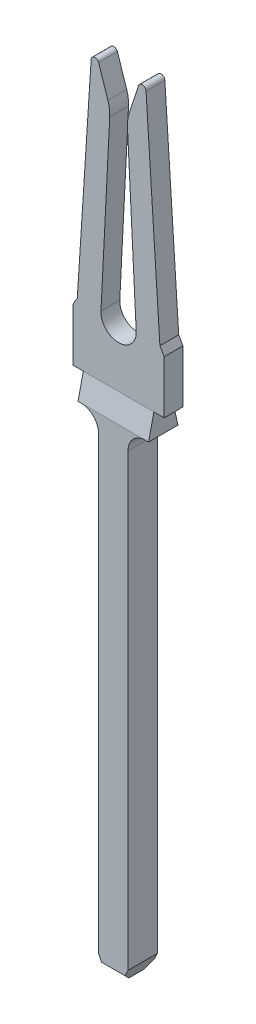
ISO-10303-21;
HEADER;
FILE_DESCRIPTION(('STEP AP214'),'2;1');
FILE_NAME('part.step','',(''),(''),'','','');
FILE_SCHEMA(('AUTOMOTIVE_DESIGN { 1 0 10303 214 1 1 1 1 }'));
ENDSEC;
DATA;
#1=APPLICATION_CONTEXT('core data for automotive mechanical design processes');
#2=APPLICATION_PROTOCOL_DEFINITION('international standard','automotive_design',2000,#1);
#3=PRODUCT_CONTEXT('',#1,'mechanical');
#4=PRODUCT('Part','Part','',(#3));
#5=PRODUCT_RELATED_PRODUCT_CATEGORY('part','',(#4));
#6=PRODUCT_DEFINITION_FORMATION('','',#4);
#7=PRODUCT_DEFINITION_CONTEXT('part definition',#1,'design');
#8=PRODUCT_DEFINITION('design','',#6,#7);
#9=PRODUCT_DEFINITION_SHAPE('','',#8);
#10=(LENGTH_UNIT() NAMED_UNIT(*) SI_UNIT(.MILLI.,.METRE.));
#11=(NAMED_UNIT(*) PLANE_ANGLE_UNIT() SI_UNIT($,.RADIAN.));
#12=(NAMED_UNIT(*) SI_UNIT($,.STERADIAN.) SOLID_ANGLE_UNIT());
#13=UNCERTAINTY_MEASURE_WITH_UNIT(LENGTH_MEASURE(1.E-05),#10,'distance_accuracy_value','');
#14=(GEOMETRIC_REPRESENTATION_CONTEXT(3) GLOBAL_UNCERTAINTY_ASSIGNED_CONTEXT((#13)) GLOBAL_UNIT_ASSIGNED_CONTEXT((#10,
#11,#12)) REPRESENTATION_CONTEXT('',''));
#15=CARTESIAN_POINT('',(0.,0.,0.));
#16=DIRECTION('',(0.,0.,1.));
#17=DIRECTION('',(1.,0.,0.));
#18=AXIS2_PLACEMENT_3D('',#15,#16,#17);
#19=CARTESIAN_POINT('',(-0.510191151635,5.91185,0.2032));
#20=DIRECTION('',(0.,0.,1.));
#21=DIRECTION('',(1.,0.,0.));
#22=AXIS2_PLACEMENT_3D('',#19,#20,#21);
#23=PLANE('',#22);
#24=DIRECTION('',(-0.0647635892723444,-0.99790063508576,0.));
#25=VECTOR('',#24,1.);
#26=CARTESIAN_POINT('',(-0.892048,1.302698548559,0.2032));
#27=LINE('',#26,#25);
#28=CARTESIAN_POINT('',(-0.892048,1.302698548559,0.2032));
#29=VERTEX_POINT('',#28);
#30=CARTESIAN_POINT('',(-0.592567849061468,5.91719623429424,0.2032));
#31=VERTEX_POINT('',#30);
#32=EDGE_CURVE('E186',#29,#31,#27,.F.);
#33=ORIENTED_EDGE('',*,*,#32,.F.);
#34=DIRECTION('',(-0.500000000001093,-0.866025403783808,0.));
#35=VECTOR('',#34,1.);
#36=CARTESIAN_POINT('',(-0.892048,1.302698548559,0.2032));
#37=LINE('',#36,#35);
#38=CARTESIAN_POINT('',(-0.984249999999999,1.143,0.2032));
#39=VERTEX_POINT('',#38);
#40=EDGE_CURVE('E178',#29,#39,#37,.T.);
#41=ORIENTED_EDGE('',*,*,#40,.T.);
#42=DIRECTION('',(0.,1.,0.));
#43=VECTOR('',#42,1.);
#44=CARTESIAN_POINT('',(-0.98425,5.91185,0.2032));
#45=LINE('',#44,#43);
#46=CARTESIAN_POINT('',(-0.98425,0.,0.2032));
#47=VERTEX_POINT('',#46);
#48=EDGE_CURVE('E161',#39,#47,#45,.F.);
#49=ORIENTED_EDGE('',*,*,#48,.T.);
#50=DIRECTION('',(1.,0.,0.));
#51=VECTOR('',#50,1.);
#52=CARTESIAN_POINT('',(-0.510191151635,0.,0.2032));
#53=LINE('',#52,#51);
#54=CARTESIAN_POINT('',(-0.762,0.,0.2032));
#55=VERTEX_POINT('',#54);
#56=EDGE_CURVE('E172',#47,#55,#53,.T.);
#57=ORIENTED_EDGE('',*,*,#56,.T.);
#58=DIRECTION('',(1.,0.,0.));
#59=VECTOR('',#58,1.);
#60=CARTESIAN_POINT('',(-0.510191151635,0.,0.2032));
#61=LINE('',#60,#59);
#62=CARTESIAN_POINT('',(0.762,0.,0.2032));
#63=VERTEX_POINT('',#62);
#64=EDGE_CURVE('E228',#55,#63,#61,.T.);
#65=ORIENTED_EDGE('',*,*,#64,.T.);
#66=DIRECTION('',(1.,0.,0.));
#67=VECTOR('',#66,1.);
#68=CARTESIAN_POINT('',(-0.510191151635,0.,0.2032));
#69=LINE('',#68,#67);
#70=CARTESIAN_POINT('',(0.98425,0.,0.2032));
#71=VERTEX_POINT('',#70);
#72=EDGE_CURVE('E192',#63,#71,#69,.T.);
#73=ORIENTED_EDGE('',*,*,#72,.T.);
#74=DIRECTION('',(0.,1.,0.));
#75=VECTOR('',#74,1.);
#76=CARTESIAN_POINT('',(0.98425,5.91185,0.2032));
#77=LINE('',#76,#75);
#78=CARTESIAN_POINT('',(0.984249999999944,1.14299999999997,0.2032));
#79=VERTEX_POINT('',#78);
#80=EDGE_CURVE('E188',#71,#79,#77,.T.);
#81=ORIENTED_EDGE('',*,*,#80,.T.);
#82=DIRECTION('',(-0.50000000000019,0.866025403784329,0.));
#83=VECTOR('',#82,1.);
#84=CARTESIAN_POINT('',(0.892048,1.302698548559,0.2032));
#85=LINE('',#84,#83);
#86=CARTESIAN_POINT('',(0.892048,1.302698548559,0.2032));
#87=VERTEX_POINT('',#86);
#88=EDGE_CURVE('E135',#87,#79,#85,.F.);
#89=ORIENTED_EDGE('',*,*,#88,.F.);
#90=DIRECTION('',(0.0647635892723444,-0.99790063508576,0.));
#91=VECTOR('',#90,1.);
#92=CARTESIAN_POINT('',(0.892048,1.302698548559,0.2032));
#93=LINE('',#92,#91);
#94=CARTESIAN_POINT('',(0.592567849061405,5.91719623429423,0.2032));
#95=VERTEX_POINT('',#94);
#96=EDGE_CURVE('E129',#87,#95,#93,.F.);
#97=ORIENTED_EDGE('',*,*,#96,.T.);
#98=CARTESIAN_POINT('',(0.510191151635,5.91185,0.2032));
#99=DIRECTION('',(0.,0.,-1.));
#100=DIRECTION('',(-1.,0.,0.));
#101=AXIS2_PLACEMENT_3D('',#98,#99,#100);
#102=CIRCLE('',#101,0.08255);
#103=CARTESIAN_POINT('',(0.431799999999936,5.93772140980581,0.2032));
#104=VERTEX_POINT('',#103);
#105=EDGE_CURVE('E20',#104,#95,#102,.T.);
#106=ORIENTED_EDGE('',*,*,#105,.F.);
#107=DIRECTION('',(0.313402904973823,0.949620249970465,0.));
#108=VECTOR('',#107,1.);
#109=CARTESIAN_POINT('',(0.4318,5.937721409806,0.2032));
#110=LINE('',#109,#108);
#111=CARTESIAN_POINT('',(0.230169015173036,5.32677344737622,0.2032));
#112=VERTEX_POINT('',#111);
#113=EDGE_CURVE('E215',#104,#112,#110,.F.);
#114=ORIENTED_EDGE('',*,*,#113,.T.);
#115=CARTESIAN_POINT('',(0.9779,5.08,0.2032));
#116=DIRECTION('',(0.,0.,-1.));
#117=DIRECTION('',(-1.,0.,0.));
#118=AXIS2_PLACEMENT_3D('',#115,#116,#117);
#119=CIRCLE('',#118,0.7874);
#120=CARTESIAN_POINT('',(0.191511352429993,5.04010444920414,0.2032));
#121=VERTEX_POINT('',#120);
#122=EDGE_CURVE('E277',#121,#112,#119,.T.);
#123=ORIENTED_EDGE('',*,*,#122,.F.);
#124=DIRECTION('',(-0.0506674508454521,0.998715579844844,0.));
#125=VECTOR('',#124,1.);
#126=CARTESIAN_POINT('',(0.19151135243,5.040104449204,0.2032));
#127=LINE('',#126,#125);
#128=CARTESIAN_POINT('',(0.380510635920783,1.31470429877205,0.2032));
#129=VERTEX_POINT('',#128);
#130=EDGE_CURVE('E210',#121,#129,#127,.F.);
#131=ORIENTED_EDGE('',*,*,#130,.T.);
#132=CARTESIAN_POINT('',(0.,1.2954,0.2032));
#133=DIRECTION('',(0.,0.,1.));
#134=DIRECTION('',(1.,0.,0.));
#135=AXIS2_PLACEMENT_3D('',#132,#133,#134);
#136=CIRCLE('',#135,0.381);
#137=CARTESIAN_POINT('',(-0.380510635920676,1.31470429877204,0.2032));
#138=VERTEX_POINT('',#137);
#139=EDGE_CURVE('E209',#129,#138,#136,.F.);
#140=ORIENTED_EDGE('',*,*,#139,.T.);
#141=DIRECTION('',(0.0506674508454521,0.998715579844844,0.));
#142=VECTOR('',#141,1.);
#143=CARTESIAN_POINT('',(-0.19151135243,5.040104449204,0.2032));
#144=LINE('',#143,#142);
#145=CARTESIAN_POINT('',(-0.191511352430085,5.04010444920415,0.2032));
#146=VERTEX_POINT('',#145);
#147=EDGE_CURVE('E205',#146,#138,#144,.F.);
#148=ORIENTED_EDGE('',*,*,#147,.F.);
#149=CARTESIAN_POINT('',(-0.9779,5.08,0.2032));
#150=DIRECTION('',(0.,0.,-1.));
#151=DIRECTION('',(-1.,0.,0.));
#152=AXIS2_PLACEMENT_3D('',#149,#150,#151);
#153=CIRCLE('',#152,0.7874);
#154=CARTESIAN_POINT('',(-0.230169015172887,5.32677344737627,0.2032));
#155=VERTEX_POINT('',#154);
#156=EDGE_CURVE('E274',#155,#146,#153,.T.);
#157=ORIENTED_EDGE('',*,*,#156,.F.);
#158=DIRECTION('',(-0.313402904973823,0.949620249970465,0.));
#159=VECTOR('',#158,1.);
#160=CARTESIAN_POINT('',(-0.4318,5.937721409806,0.2032));
#161=LINE('',#160,#159);
#162=CARTESIAN_POINT('',(-0.431799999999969,5.9377214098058,0.2032));
#163=VERTEX_POINT('',#162);
#164=EDGE_CURVE('E200',#163,#155,#161,.F.);
#165=ORIENTED_EDGE('',*,*,#164,.F.);
#166=CARTESIAN_POINT('',(-0.510191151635,5.91185,0.2032));
#167=DIRECTION('',(0.,0.,-1.));
#168=DIRECTION('',(-1.,0.,0.));
#169=AXIS2_PLACEMENT_3D('',#166,#167,#168);
#170=CIRCLE('',#169,0.08255);
#171=EDGE_CURVE('E270',#31,#163,#170,.T.);
#172=ORIENTED_EDGE('',*,*,#171,.F.);
#173=EDGE_LOOP('',(#33,#41,#49,#57,#65,#73,#81,#89,#97,#106,#114,#123,#131,#140,#148,#157,#165,#172));
#174=FACE_BOUND('',#173,.T.);
#175=ADVANCED_FACE('F17',(#174),#23,.T.);
#176=CARTESIAN_POINT('',(0.892048,1.302698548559,0.2032));
#177=DIRECTION('',(0.866025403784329,0.50000000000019,0.));
#178=DIRECTION('',(-0.50000000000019,0.866025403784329,0.));
#179=AXIS2_PLACEMENT_3D('',#176,#177,#178);
#180=PLANE('',#179);
#181=ORIENTED_EDGE('',*,*,#88,.T.);
#182=DIRECTION('',(0.,0.,1.));
#183=VECTOR('',#182,1.);
#184=CARTESIAN_POINT('',(0.98425,1.143,0.2032));
#185=LINE('',#184,#183);
#186=CARTESIAN_POINT('',(0.98425,1.143,-0.2032));
#187=VERTEX_POINT('',#186);
#188=EDGE_CURVE('E182',#79,#187,#185,.F.);
#189=ORIENTED_EDGE('',*,*,#188,.T.);
#190=DIRECTION('',(-0.500000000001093,0.866025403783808,0.));
#191=VECTOR('',#190,1.);
#192=CARTESIAN_POINT('',(0.98425,1.143,-0.2032));
#193=LINE('',#192,#191);
#194=CARTESIAN_POINT('',(0.892048,1.302698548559,-0.2032));
#195=VERTEX_POINT('',#194);
#196=EDGE_CURVE('E293',#187,#195,#193,.T.);
#197=ORIENTED_EDGE('',*,*,#196,.T.);
#198=DIRECTION('',(0.,0.,1.));
#199=VECTOR('',#198,1.);
#200=CARTESIAN_POINT('',(0.892048,1.302698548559,0.2032));
#201=LINE('',#200,#199);
#202=EDGE_CURVE('E190',#195,#87,#201,.T.);
#203=ORIENTED_EDGE('',*,*,#202,.T.);
#204=EDGE_LOOP('',(#181,#189,#197,#203));
#205=FACE_BOUND('',#204,.T.);
#206=ADVANCED_FACE('F394',(#205),#180,.T.);
#207=CARTESIAN_POINT('',(0.892048,1.302698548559,0.2032));
#208=DIRECTION('',(-0.99790063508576,-0.0647635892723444,0.));
#209=DIRECTION('',(0.0647635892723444,-0.99790063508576,0.));
#210=AXIS2_PLACEMENT_3D('',#207,#208,#209);
#211=PLANE('',#210);
#212=DIRECTION('',(0.,0.,-1.));
#213=VECTOR('',#212,1.);
#214=CARTESIAN_POINT('',(0.592567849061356,5.91719623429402,0.2032));
#215=LINE('',#214,#213);
#216=CARTESIAN_POINT('',(0.592567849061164,5.91719623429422,-0.2032));
#217=VERTEX_POINT('',#216);
#218=EDGE_CURVE('E287',#95,#217,#215,.T.);
#219=ORIENTED_EDGE('',*,*,#218,.F.);
#220=ORIENTED_EDGE('',*,*,#96,.F.);
#221=ORIENTED_EDGE('',*,*,#202,.F.);
#222=DIRECTION('',(-0.0647635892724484,0.997900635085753,0.));
#223=VECTOR('',#222,1.);
#224=CARTESIAN_POINT('',(0.892048,1.302698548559,-0.2032));
#225=LINE('',#224,#223);
#226=EDGE_CURVE('E269',#195,#217,#225,.T.);
#227=ORIENTED_EDGE('',*,*,#226,.T.);
#228=EDGE_LOOP('',(#219,#220,#221,#227));
#229=FACE_BOUND('',#228,.T.);
#230=ADVANCED_FACE('F397',(#229),#211,.F.);
#231=CARTESIAN_POINT('',(0.510191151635,5.91185,0.2032));
#232=DIRECTION('',(0.,0.,-1.));
#233=DIRECTION('',(-1.,0.,0.));
#234=AXIS2_PLACEMENT_3D('',#231,#232,#233);
#235=CYLINDRICAL_SURFACE('',#234,0.08255);
#236=ORIENTED_EDGE('',*,*,#105,.T.);
#237=ORIENTED_EDGE('',*,*,#218,.T.);
#238=CARTESIAN_POINT('',(0.510191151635,5.91185,-0.2032));
#239=DIRECTION('',(0.,0.,-1.));
#240=DIRECTION('',(-1.,0.,0.));
#241=AXIS2_PLACEMENT_3D('',#238,#239,#240);
#242=CIRCLE('',#241,0.08255);
#243=CARTESIAN_POINT('',(0.431799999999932,5.93772140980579,-0.2032));
#244=VERTEX_POINT('',#243);
#245=EDGE_CURVE('E267',#217,#244,#242,.F.);
#246=ORIENTED_EDGE('',*,*,#245,.T.);
#247=DIRECTION('',(0.,0.,1.));
#248=VECTOR('',#247,1.);
#249=CARTESIAN_POINT('',(0.4318,5.937721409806,0.2032));
#250=LINE('',#249,#248);
#251=EDGE_CURVE('E218',#244,#104,#250,.T.);
#252=ORIENTED_EDGE('',*,*,#251,.T.);
#253=EDGE_LOOP('',(#236,#237,#246,#252));
#254=FACE_BOUND('',#253,.T.);
#255=ADVANCED_FACE('F399',(#254),#235,.T.);
#256=CARTESIAN_POINT('',(0.4318,5.937721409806,0.2032));
#257=DIRECTION('',(0.949620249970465,-0.313402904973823,0.));
#258=DIRECTION('',(0.313402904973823,0.949620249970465,0.));
#259=AXIS2_PLACEMENT_3D('',#256,#257,#258);
#260=PLANE('',#259);
#261=DIRECTION('',(0.,0.,-1.));
#262=VECTOR('',#261,1.);
#263=CARTESIAN_POINT('',(0.230169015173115,5.32677344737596,0.2032));
#264=LINE('',#263,#262);
#265=CARTESIAN_POINT('',(0.230169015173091,5.32677344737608,-0.2032));
#266=VERTEX_POINT('',#265);
#267=EDGE_CURVE('E217',#112,#266,#264,.T.);
#268=ORIENTED_EDGE('',*,*,#267,.F.);
#269=ORIENTED_EDGE('',*,*,#113,.F.);
#270=ORIENTED_EDGE('',*,*,#251,.F.);
#271=DIRECTION('',(-0.313402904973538,-0.949620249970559,0.));
#272=VECTOR('',#271,1.);
#273=CARTESIAN_POINT('',(0.4318,5.937721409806,-0.2032));
#274=LINE('',#273,#272);
#275=EDGE_CURVE('E266',#244,#266,#274,.T.);
#276=ORIENTED_EDGE('',*,*,#275,.T.);
#277=EDGE_LOOP('',(#268,#269,#270,#276));
#278=FACE_BOUND('',#277,.T.);
#279=ADVANCED_FACE('F341',(#278),#260,.F.);
#280=CARTESIAN_POINT('',(0.9779,5.08,0.2032));
#281=DIRECTION('',(0.,0.,-1.));
#282=DIRECTION('',(-1.,0.,0.));
#283=AXIS2_PLACEMENT_3D('',#280,#281,#282);
#284=CYLINDRICAL_SURFACE('',#283,0.7874);
#285=CARTESIAN_POINT('',(0.9779,5.08,-0.2032));
#286=DIRECTION('',(0.,0.,-1.));
#287=DIRECTION('',(-1.,0.,0.));
#288=AXIS2_PLACEMENT_3D('',#285,#286,#287);
#289=CIRCLE('',#288,0.7874);
#290=CARTESIAN_POINT('',(0.191511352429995,5.04010444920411,-0.2032));
#291=VERTEX_POINT('',#290);
#292=EDGE_CURVE('E264',#266,#291,#289,.F.);
#293=ORIENTED_EDGE('',*,*,#292,.T.);
#294=DIRECTION('',(0.,0.,1.));
#295=VECTOR('',#294,1.);
#296=CARTESIAN_POINT('',(0.19151135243,5.040104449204,0.2032));
#297=LINE('',#296,#295);
#298=EDGE_CURVE('E214',#291,#121,#297,.T.);
#299=ORIENTED_EDGE('',*,*,#298,.T.);
#300=ORIENTED_EDGE('',*,*,#122,.T.);
#301=ORIENTED_EDGE('',*,*,#267,.T.);
#302=EDGE_LOOP('',(#293,#299,#300,#301));
#303=FACE_BOUND('',#302,.T.);
#304=ADVANCED_FACE('F334',(#303),#284,.T.);
#305=CARTESIAN_POINT('',(0.19151135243,5.040104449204,0.2032));
#306=DIRECTION('',(0.998715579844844,0.0506674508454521,0.));
#307=DIRECTION('',(-0.0506674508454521,0.998715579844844,0.));
#308=AXIS2_PLACEMENT_3D('',#305,#306,#307);
#309=PLANE('',#308);
#310=DIRECTION('',(0.,0.,-1.));
#311=VECTOR('',#310,1.);
#312=CARTESIAN_POINT('',(0.380510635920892,1.31470429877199,0.2032));
#313=LINE('',#312,#311);
#314=CARTESIAN_POINT('',(0.380510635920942,1.31470429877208,-0.2032));
#315=VERTEX_POINT('',#314);
#316=EDGE_CURVE('E213',#315,#129,#313,.F.);
#317=ORIENTED_EDGE('',*,*,#316,.T.);
#318=ORIENTED_EDGE('',*,*,#130,.F.);
#319=ORIENTED_EDGE('',*,*,#298,.F.);
#320=DIRECTION('',(0.050667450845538,-0.99871557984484,0.));
#321=VECTOR('',#320,1.);
#322=CARTESIAN_POINT('',(0.19151135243,5.040104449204,-0.2032));
#323=LINE('',#322,#321);
#324=EDGE_CURVE('E263',#291,#315,#323,.T.);
#325=ORIENTED_EDGE('',*,*,#324,.T.);
#326=EDGE_LOOP('',(#317,#318,#319,#325));
#327=FACE_BOUND('',#326,.T.);
#328=ADVANCED_FACE('F327',(#327),#309,.F.);
#329=CARTESIAN_POINT('',(0.,1.2954,0.2032));
#330=DIRECTION('',(0.,0.,-1.));
#331=DIRECTION('',(-1.,0.,0.));
#332=AXIS2_PLACEMENT_3D('',#329,#330,#331);
#333=CYLINDRICAL_SURFACE('',#332,0.381);
#334=CARTESIAN_POINT('',(0.,1.2954,-0.2032));
#335=DIRECTION('',(0.,0.,-1.));
#336=DIRECTION('',(-1.,0.,0.));
#337=AXIS2_PLACEMENT_3D('',#334,#335,#336);
#338=CIRCLE('',#337,0.381);
#339=CARTESIAN_POINT('',(-0.380510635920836,1.31470429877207,-0.2032));
#340=VERTEX_POINT('',#339);
#341=EDGE_CURVE('E261',#315,#340,#338,.T.);
#342=ORIENTED_EDGE('',*,*,#341,.T.);
#343=DIRECTION('',(0.,0.,1.));
#344=VECTOR('',#343,1.);
#345=CARTESIAN_POINT('',(-0.38051063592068,1.31470429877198,0.2032));
#346=LINE('',#345,#344);
#347=EDGE_CURVE('E208',#138,#340,#346,.F.);
#348=ORIENTED_EDGE('',*,*,#347,.F.);
#349=ORIENTED_EDGE('',*,*,#139,.F.);
#350=ORIENTED_EDGE('',*,*,#316,.F.);
#351=EDGE_LOOP('',(#342,#348,#349,#350));
#352=FACE_BOUND('',#351,.T.);
#353=ADVANCED_FACE('F331',(#352),#333,.F.);
#354=CARTESIAN_POINT('',(-0.19151135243,5.040104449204,0.2032));
#355=DIRECTION('',(0.998715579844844,-0.0506674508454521,0.));
#356=DIRECTION('',(0.0506674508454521,0.998715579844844,0.));
#357=AXIS2_PLACEMENT_3D('',#354,#355,#356);
#358=PLANE('',#357);
#359=ORIENTED_EDGE('',*,*,#147,.T.);
#360=ORIENTED_EDGE('',*,*,#347,.T.);
#361=DIRECTION('',(0.050667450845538,0.99871557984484,0.));
#362=VECTOR('',#361,1.);
#363=CARTESIAN_POINT('',(-0.380510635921,1.314704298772,-0.2032));
#364=LINE('',#363,#362);
#365=CARTESIAN_POINT('',(-0.191511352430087,5.04010444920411,-0.2032));
#366=VERTEX_POINT('',#365);
#367=EDGE_CURVE('E260',#340,#366,#364,.T.);
#368=ORIENTED_EDGE('',*,*,#367,.T.);
#369=DIRECTION('',(0.,0.,-1.));
#370=VECTOR('',#369,1.);
#371=CARTESIAN_POINT('',(-0.191511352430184,5.04010444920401,0.2032));
#372=LINE('',#371,#370);
#373=EDGE_CURVE('E204',#146,#366,#372,.T.);
#374=ORIENTED_EDGE('',*,*,#373,.F.);
#375=EDGE_LOOP('',(#359,#360,#368,#374));
#376=FACE_BOUND('',#375,.T.);
#377=ADVANCED_FACE('F509',(#376),#358,.T.);
#378=CARTESIAN_POINT('',(-0.9779,5.08,0.2032));
#379=DIRECTION('',(0.,0.,-1.));
#380=DIRECTION('',(-1.,0.,0.));
#381=AXIS2_PLACEMENT_3D('',#378,#379,#380);
#382=CYLINDRICAL_SURFACE('',#381,0.7874);
#383=ORIENTED_EDGE('',*,*,#156,.T.);
#384=ORIENTED_EDGE('',*,*,#373,.T.);
#385=CARTESIAN_POINT('',(-0.9779,5.08,-0.2032));
#386=DIRECTION('',(0.,0.,-1.));
#387=DIRECTION('',(-1.,0.,0.));
#388=AXIS2_PLACEMENT_3D('',#385,#386,#387);
#389=CIRCLE('',#388,0.7874);
#390=CARTESIAN_POINT('',(-0.230169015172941,5.32677344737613,-0.2032));
#391=VERTEX_POINT('',#390);
#392=EDGE_CURVE('E258',#366,#391,#389,.F.);
#393=ORIENTED_EDGE('',*,*,#392,.T.);
#394=DIRECTION('',(0.,0.,1.));
#395=VECTOR('',#394,1.);
#396=CARTESIAN_POINT('',(-0.230169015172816,5.32677344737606,0.2032));
#397=LINE('',#396,#395);
#398=EDGE_CURVE('E203',#155,#391,#397,.F.);
#399=ORIENTED_EDGE('',*,*,#398,.F.);
#400=EDGE_LOOP('',(#383,#384,#393,#399));
#401=FACE_BOUND('',#400,.T.);
#402=ADVANCED_FACE('F505',(#401),#382,.T.);
#403=CARTESIAN_POINT('',(-0.4318,5.937721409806,0.2032));
#404=DIRECTION('',(0.949620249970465,0.313402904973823,0.));
#405=DIRECTION('',(-0.313402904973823,0.949620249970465,0.));
#406=AXIS2_PLACEMENT_3D('',#403,#404,#405);
#407=PLANE('',#406);
#408=ORIENTED_EDGE('',*,*,#164,.T.);
#409=ORIENTED_EDGE('',*,*,#398,.T.);
#410=DIRECTION('',(-0.313402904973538,0.949620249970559,0.));
#411=VECTOR('',#410,1.);
#412=CARTESIAN_POINT('',(-0.230169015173,5.326773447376,-0.2032));
#413=LINE('',#412,#411);
#414=CARTESIAN_POINT('',(-0.431799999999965,5.93772140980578,-0.2032));
#415=VERTEX_POINT('',#414);
#416=EDGE_CURVE('E257',#391,#415,#413,.T.);
#417=ORIENTED_EDGE('',*,*,#416,.T.);
#418=DIRECTION('',(0.,0.,-1.));
#419=VECTOR('',#418,1.);
#420=CARTESIAN_POINT('',(-0.431800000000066,5.93772140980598,0.2032));
#421=LINE('',#420,#419);
#422=EDGE_CURVE('E273',#163,#415,#421,.T.);
#423=ORIENTED_EDGE('',*,*,#422,.F.);
#424=EDGE_LOOP('',(#408,#409,#417,#423));
#425=FACE_BOUND('',#424,.T.);
#426=ADVANCED_FACE('F502',(#425),#407,.T.);
#427=CARTESIAN_POINT('',(-0.510191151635,5.91185,0.2032));
#428=DIRECTION('',(0.,0.,-1.));
#429=DIRECTION('',(-1.,0.,0.));
#430=AXIS2_PLACEMENT_3D('',#427,#428,#429);
#431=CYLINDRICAL_SURFACE('',#430,0.08255);
#432=ORIENTED_EDGE('',*,*,#171,.T.);
#433=ORIENTED_EDGE('',*,*,#422,.T.);
#434=CARTESIAN_POINT('',(-0.510191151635,5.91185,-0.2032));
#435=DIRECTION('',(0.,0.,-1.));
#436=DIRECTION('',(-1.,0.,0.));
#437=AXIS2_PLACEMENT_3D('',#434,#435,#436);
#438=CIRCLE('',#437,0.08255);
#439=CARTESIAN_POINT('',(-0.592567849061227,5.91719623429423,-0.2032));
#440=VERTEX_POINT('',#439);
#441=EDGE_CURVE('E254',#415,#440,#438,.F.);
#442=ORIENTED_EDGE('',*,*,#441,.T.);
#443=DIRECTION('',(0.,0.,1.));
#444=VECTOR('',#443,1.);
#445=CARTESIAN_POINT('',(-0.592567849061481,5.91719623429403,0.2032));
#446=LINE('',#445,#444);
#447=EDGE_CURVE('E304',#31,#440,#446,.F.);
#448=ORIENTED_EDGE('',*,*,#447,.F.);
#449=EDGE_LOOP('',(#432,#433,#442,#448));
#450=FACE_BOUND('',#449,.T.);
#451=ADVANCED_FACE('F499',(#450),#431,.T.);
#452=CARTESIAN_POINT('',(-0.892048,1.302698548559,0.2032));
#453=DIRECTION('',(-0.99790063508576,0.0647635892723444,0.));
#454=DIRECTION('',(-0.0647635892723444,-0.99790063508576,0.));
#455=AXIS2_PLACEMENT_3D('',#452,#453,#454);
#456=PLANE('',#455);
#457=ORIENTED_EDGE('',*,*,#32,.T.);
#458=ORIENTED_EDGE('',*,*,#447,.T.);
#459=DIRECTION('',(-0.0647635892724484,-0.997900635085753,0.));
#460=VECTOR('',#459,1.);
#461=CARTESIAN_POINT('',(-0.592567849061,5.917196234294,-0.2032));
#462=LINE('',#461,#460);
#463=CARTESIAN_POINT('',(-0.892048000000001,1.302698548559,-0.2032));
#464=VERTEX_POINT('',#463);
#465=EDGE_CURVE('E256',#440,#464,#462,.T.);
#466=ORIENTED_EDGE('',*,*,#465,.T.);
#467=DIRECTION('',(0.,0.,1.));
#468=VECTOR('',#467,1.);
#469=CARTESIAN_POINT('',(-0.892048,1.302698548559,0.2032));
#470=LINE('',#469,#468);
#471=EDGE_CURVE('E183',#464,#29,#470,.T.);
#472=ORIENTED_EDGE('',*,*,#471,.T.);
#473=EDGE_LOOP('',(#457,#458,#466,#472));
#474=FACE_BOUND('',#473,.T.);
#475=ADVANCED_FACE('F375',(#474),#456,.T.);
#476=CARTESIAN_POINT('',(-0.892048,1.302698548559,0.2032));
#477=DIRECTION('',(0.866025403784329,-0.50000000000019,0.));
#478=DIRECTION('',(0.50000000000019,0.866025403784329,0.));
#479=AXIS2_PLACEMENT_3D('',#476,#477,#478);
#480=PLANE('',#479);
#481=DIRECTION('',(0.,0.,1.));
#482=VECTOR('',#481,1.);
#483=CARTESIAN_POINT('',(-0.98425,1.143,0.2032));
#484=LINE('',#483,#482);
#485=CARTESIAN_POINT('',(-0.98425,1.143,-0.2032));
#486=VERTEX_POINT('',#485);
#487=EDGE_CURVE('E166',#39,#486,#484,.F.);
#488=ORIENTED_EDGE('',*,*,#487,.F.);
#489=ORIENTED_EDGE('',*,*,#40,.F.);
#490=ORIENTED_EDGE('',*,*,#471,.F.);
#491=DIRECTION('',(-0.500000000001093,-0.866025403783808,0.));
#492=VECTOR('',#491,1.);
#493=CARTESIAN_POINT('',(-0.892048,1.302698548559,-0.2032));
#494=LINE('',#493,#492);
#495=EDGE_CURVE('E181',#464,#486,#494,.T.);
#496=ORIENTED_EDGE('',*,*,#495,.T.);
#497=EDGE_LOOP('',(#488,#489,#490,#496));
#498=FACE_BOUND('',#497,.T.);
#499=ADVANCED_FACE('F176',(#498),#480,.F.);
#500=CARTESIAN_POINT('',(-0.98425,0.,0.2032));
#501=DIRECTION('',(-1.,0.,0.));
#502=DIRECTION('',(0.,0.,1.));
#503=AXIS2_PLACEMENT_3D('',#500,#501,#502);
#504=PLANE('',#503);
#505=ORIENTED_EDGE('',*,*,#48,.F.);
#506=ORIENTED_EDGE('',*,*,#487,.T.);
#507=DIRECTION('',(0.,1.,0.));
#508=VECTOR('',#507,1.);
#509=CARTESIAN_POINT('',(-0.98425,5.91185,-0.2032));
#510=LINE('',#509,#508);
#511=CARTESIAN_POINT('',(-0.98425,0.,-0.2032));
#512=VERTEX_POINT('',#511);
#513=EDGE_CURVE('E360',#486,#512,#510,.F.);
#514=ORIENTED_EDGE('',*,*,#513,.T.);
#515=DIRECTION('',(0.,0.,-1.));
#516=VECTOR('',#515,1.);
#517=CARTESIAN_POINT('',(-0.98425,0.,0.2032));
#518=LINE('',#517,#516);
#519=EDGE_CURVE('E169',#47,#512,#518,.T.);
#520=ORIENTED_EDGE('',*,*,#519,.F.);
#521=EDGE_LOOP('',(#505,#506,#514,#520));
#522=FACE_BOUND('',#521,.T.);
#523=ADVANCED_FACE('F163',(#522),#504,.T.);
#524=CARTESIAN_POINT('',(0.98425,0.,0.2032));
#525=DIRECTION('',(-1.,0.,0.));
#526=DIRECTION('',(0.,0.,1.));
#527=AXIS2_PLACEMENT_3D('',#524,#525,#526);
#528=PLANE('',#527);
#529=ORIENTED_EDGE('',*,*,#188,.F.);
#530=ORIENTED_EDGE('',*,*,#80,.F.);
#531=DIRECTION('',(0.,0.,-1.));
#532=VECTOR('',#531,1.);
#533=CARTESIAN_POINT('',(0.98425,0.,0.2032));
#534=LINE('',#533,#532);
#535=CARTESIAN_POINT('',(0.98425,0.,-0.2032));
#536=VERTEX_POINT('',#535);
#537=EDGE_CURVE('E353',#536,#71,#534,.F.);
#538=ORIENTED_EDGE('',*,*,#537,.F.);
#539=DIRECTION('',(0.,1.,0.));
#540=VECTOR('',#539,1.);
#541=CARTESIAN_POINT('',(0.98425,5.91185,-0.2032));
#542=LINE('',#541,#540);
#543=EDGE_CURVE('E296',#536,#187,#542,.T.);
#544=ORIENTED_EDGE('',*,*,#543,.T.);
#545=EDGE_LOOP('',(#529,#530,#538,#544));
#546=FACE_BOUND('',#545,.T.);
#547=ADVANCED_FACE('F489',(#546),#528,.F.);
#548=CARTESIAN_POINT('',(-0.510191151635,5.91185,-0.2032));
#549=DIRECTION('',(0.,0.,1.));
#550=DIRECTION('',(1.,0.,0.));
#551=AXIS2_PLACEMENT_3D('',#548,#549,#550);
#552=PLANE('',#551);
#553=ORIENTED_EDGE('',*,*,#495,.F.);
#554=ORIENTED_EDGE('',*,*,#465,.F.);
#555=ORIENTED_EDGE('',*,*,#441,.F.);
#556=ORIENTED_EDGE('',*,*,#416,.F.);
#557=ORIENTED_EDGE('',*,*,#392,.F.);
#558=ORIENTED_EDGE('',*,*,#367,.F.);
#559=ORIENTED_EDGE('',*,*,#341,.F.);
#560=ORIENTED_EDGE('',*,*,#324,.F.);
#561=ORIENTED_EDGE('',*,*,#292,.F.);
#562=ORIENTED_EDGE('',*,*,#275,.F.);
#563=ORIENTED_EDGE('',*,*,#245,.F.);
#564=ORIENTED_EDGE('',*,*,#226,.F.);
#565=ORIENTED_EDGE('',*,*,#196,.F.);
#566=ORIENTED_EDGE('',*,*,#543,.F.);
#567=DIRECTION('',(1.,0.,0.));
#568=VECTOR('',#567,1.);
#569=CARTESIAN_POINT('',(0.98425,0.,-0.2032));
#570=LINE('',#569,#568);
#571=CARTESIAN_POINT('',(0.762,0.,-0.2032));
#572=VERTEX_POINT('',#571);
#573=EDGE_CURVE('E357',#572,#536,#570,.T.);
#574=ORIENTED_EDGE('',*,*,#573,.F.);
#575=DIRECTION('',(1.,0.,0.));
#576=VECTOR('',#575,1.);
#577=CARTESIAN_POINT('',(-0.98425,0.,-0.2032));
#578=LINE('',#577,#576);
#579=CARTESIAN_POINT('',(-0.762,0.,-0.2032));
#580=VERTEX_POINT('',#579);
#581=EDGE_CURVE('E356',#572,#580,#578,.F.);
#582=ORIENTED_EDGE('',*,*,#581,.T.);
#583=DIRECTION('',(1.,0.,0.));
#584=VECTOR('',#583,1.);
#585=CARTESIAN_POINT('',(0.98425,0.,-0.2032));
#586=LINE('',#585,#584);
#587=EDGE_CURVE('E365',#512,#580,#586,.T.);
#588=ORIENTED_EDGE('',*,*,#587,.F.);
#589=ORIENTED_EDGE('',*,*,#513,.F.);
#590=EDGE_LOOP('',(#553,#554,#555,#556,#557,#558,#559,#560,#561,#562,#563,#564,#565,#566,#574,
#582,#588,#589));
#591=FACE_BOUND('',#590,.T.);
#592=ADVANCED_FACE('F337',(#591),#552,.F.);
#593=CARTESIAN_POINT('',(0.98425,0.,0.2032));
#594=DIRECTION('',(0.,-1.,0.));
#595=DIRECTION('',(0.,0.,-1.));
#596=AXIS2_PLACEMENT_3D('',#593,#594,#595);
#597=PLANE('',#596);
#598=ORIENTED_EDGE('',*,*,#519,.T.);
#599=ORIENTED_EDGE('',*,*,#587,.T.);
#600=DIRECTION('',(0.,0.,1.));
#601=VECTOR('',#600,1.);
#602=CARTESIAN_POINT('',(-0.762,0.,0.3175));
#603=LINE('',#602,#601);
#604=EDGE_CURVE('E699',#580,#55,#603,.T.);
#605=ORIENTED_EDGE('',*,*,#604,.T.);
#606=ORIENTED_EDGE('',*,*,#56,.F.);
#607=EDGE_LOOP('',(#598,#599,#605,#606));
#608=FACE_BOUND('',#607,.T.);
#609=ADVANCED_FACE('F482',(#608),#597,.T.);
#610=CARTESIAN_POINT('',(0.98425,0.,0.2032));
#611=DIRECTION('',(0.,-1.,0.));
#612=DIRECTION('',(0.,0.,-1.));
#613=AXIS2_PLACEMENT_3D('',#610,#611,#612);
#614=PLANE('',#613);
#615=ORIENTED_EDGE('',*,*,#573,.T.);
#616=ORIENTED_EDGE('',*,*,#537,.T.);
#617=ORIENTED_EDGE('',*,*,#72,.F.);
#618=DIRECTION('',(0.,0.,1.));
#619=VECTOR('',#618,1.);
#620=CARTESIAN_POINT('',(0.762,0.,0.3175));
#621=LINE('',#620,#619);
#622=EDGE_CURVE('E693',#63,#572,#621,.F.);
#623=ORIENTED_EDGE('',*,*,#622,.T.);
#624=EDGE_LOOP('',(#615,#616,#617,#623));
#625=FACE_BOUND('',#624,.T.);
#626=ADVANCED_FACE('F478',(#625),#614,.T.);
#627=CARTESIAN_POINT('',(-0.98425,0.,-0.2032));
#628=DIRECTION('',(0.,-0.219512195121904,0.975609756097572));
#629=DIRECTION('',(0.,-0.975609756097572,-0.219512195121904));
#630=AXIS2_PLACEMENT_3D('',#627,#628,#629);
#631=PLANE('',#630);
#632=DIRECTION('',(0.,-0.975609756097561,-0.219512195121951));
#633=VECTOR('',#632,1.);
#634=CARTESIAN_POINT('',(0.762,0.,-0.2032));
#635=LINE('',#634,#633);
#636=CARTESIAN_POINT('',(0.762,-0.508,-0.3175));
#637=VERTEX_POINT('',#636);
#638=EDGE_CURVE('E689',#572,#637,#635,.T.);
#639=ORIENTED_EDGE('',*,*,#638,.T.);
#640=DIRECTION('',(1.,0.,0.));
#641=VECTOR('',#640,1.);
#642=CARTESIAN_POINT('',(-0.762,-0.508,-0.3175));
#643=LINE('',#642,#641);
#644=CARTESIAN_POINT('',(0.6985,-0.508,-0.3175));
#645=VERTEX_POINT('',#644);
#646=EDGE_CURVE('E745',#637,#645,#643,.F.);
#647=ORIENTED_EDGE('',*,*,#646,.T.);
#648=DIRECTION('',(1.,0.,0.));
#649=VECTOR('',#648,1.);
#650=CARTESIAN_POINT('',(-0.3175,-0.508,-0.3175));
#651=LINE('',#650,#649);
#652=CARTESIAN_POINT('',(-0.6985,-0.508,-0.3175));
#653=VERTEX_POINT('',#652);
#654=EDGE_CURVE('E728',#645,#653,#651,.F.);
#655=ORIENTED_EDGE('',*,*,#654,.T.);
#656=DIRECTION('',(1.,0.,0.));
#657=VECTOR('',#656,1.);
#658=CARTESIAN_POINT('',(-0.762,-0.508,-0.3175));
#659=LINE('',#658,#657);
#660=CARTESIAN_POINT('',(-0.762,-0.508,-0.3175));
#661=VERTEX_POINT('',#660);
#662=EDGE_CURVE('E781',#653,#661,#659,.F.);
#663=ORIENTED_EDGE('',*,*,#662,.T.);
#664=DIRECTION('',(0.,0.975609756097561,0.219512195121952));
#665=VECTOR('',#664,1.);
#666=CARTESIAN_POINT('',(-0.762,-0.508,-0.3175));
#667=LINE('',#666,#665);
#668=EDGE_CURVE('E696',#661,#580,#667,.T.);
#669=ORIENTED_EDGE('',*,*,#668,.T.);
#670=ORIENTED_EDGE('',*,*,#581,.F.);
#671=EDGE_LOOP('',(#639,#647,#655,#663,#669,#670));
#672=FACE_BOUND('',#671,.T.);
#673=ADVANCED_FACE('F474',(#672),#631,.F.);
#674=CARTESIAN_POINT('',(0.3175,-10.8966,0.3175));
#675=DIRECTION('',(0.,-1.,0.));
#676=DIRECTION('',(0.,0.,-1.));
#677=AXIS2_PLACEMENT_3D('',#674,#675,#676);
#678=PLANE('',#677);
#679=DIRECTION('',(0.,0.,1.));
#680=VECTOR('',#679,1.);
#681=CARTESIAN_POINT('',(0.184149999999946,-10.8966,0.3175));
#682=LINE('',#681,#680);
#683=CARTESIAN_POINT('',(0.184149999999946,-10.8966,0.1651));
#684=VERTEX_POINT('',#683);
#685=CARTESIAN_POINT('',(0.184149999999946,-10.8966,-0.1651));
#686=VERTEX_POINT('',#685);
#687=EDGE_CURVE('E722',#684,#686,#682,.F.);
#688=ORIENTED_EDGE('',*,*,#687,.F.);
#689=DIRECTION('',(1.,0.,0.));
#690=VECTOR('',#689,1.);
#691=CARTESIAN_POINT('',(0.3175,-10.8966,0.1651));
#692=LINE('',#691,#690);
#693=CARTESIAN_POINT('',(-0.18415,-10.8966,0.1651));
#694=VERTEX_POINT('',#693);
#695=EDGE_CURVE('E711',#684,#694,#692,.F.);
#696=ORIENTED_EDGE('',*,*,#695,.T.);
#697=DIRECTION('',(0.,0.,1.));
#698=VECTOR('',#697,1.);
#699=CARTESIAN_POINT('',(-0.18415,-10.8966,0.3175));
#700=LINE('',#699,#698);
#701=CARTESIAN_POINT('',(-0.18415,-10.8966,-0.1651));
#702=VERTEX_POINT('',#701);
#703=EDGE_CURVE('E705',#702,#694,#700,.T.);
#704=ORIENTED_EDGE('',*,*,#703,.F.);
#705=DIRECTION('',(1.,0.,0.));
#706=VECTOR('',#705,1.);
#707=CARTESIAN_POINT('',(-0.3175,-10.8966,-0.1651));
#708=LINE('',#707,#706);
#709=EDGE_CURVE('E686',#686,#702,#708,.F.);
#710=ORIENTED_EDGE('',*,*,#709,.F.);
#711=EDGE_LOOP('',(#688,#696,#704,#710));
#712=FACE_BOUND('',#711,.T.);
#713=ADVANCED_FACE('F470',(#712),#678,.T.);
#714=CARTESIAN_POINT('',(-0.3175,-10.7442,-0.3175));
#715=DIRECTION('',(0.,-0.707106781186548,-0.707106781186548));
#716=DIRECTION('',(0.,0.707106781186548,-0.707106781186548));
#717=AXIS2_PLACEMENT_3D('',#714,#715,#716);
#718=PLANE('',#717);
#719=DIRECTION('',(0.31314561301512,-0.671542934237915,0.671542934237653));
#720=VECTOR('',#719,1.);
#721=CARTESIAN_POINT('',(-0.255215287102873,-10.7441999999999,-0.3175));
#722=LINE('',#721,#720);
#723=CARTESIAN_POINT('',(-0.255215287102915,-10.7442,-0.3175));
#724=VERTEX_POINT('',#723);
#725=EDGE_CURVE('E702',#724,#702,#722,.T.);
#726=ORIENTED_EDGE('',*,*,#725,.F.);
#727=DIRECTION('',(1.,0.,0.));
#728=VECTOR('',#727,1.);
#729=CARTESIAN_POINT('',(-0.3175,-10.7442,-0.3175));
#730=LINE('',#729,#728);
#731=CARTESIAN_POINT('',(0.255215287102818,-10.7441999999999,-0.3175));
#732=VERTEX_POINT('',#731);
#733=EDGE_CURVE('E725',#724,#732,#730,.T.);
#734=ORIENTED_EDGE('',*,*,#733,.T.);
#735=DIRECTION('',(0.31314561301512,0.671542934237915,-0.671542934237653));
#736=VECTOR('',#735,1.);
#737=CARTESIAN_POINT('',(0.184149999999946,-10.8966,-0.1651));
#738=LINE('',#737,#736);
#739=EDGE_CURVE('E718',#686,#732,#738,.T.);
#740=ORIENTED_EDGE('',*,*,#739,.F.);
#741=ORIENTED_EDGE('',*,*,#709,.T.);
#742=EDGE_LOOP('',(#726,#734,#740,#741));
#743=FACE_BOUND('',#742,.T.);
#744=ADVANCED_FACE('F466',(#743),#718,.T.);
#745=CARTESIAN_POINT('',(-0.762,0.,0.3175));
#746=DIRECTION('',(1.,0.,0.));
#747=DIRECTION('',(0.,1.,0.));
#748=AXIS2_PLACEMENT_3D('',#745,#746,#747);
#749=PLANE('',#748);
#750=ORIENTED_EDGE('',*,*,#668,.F.);
#751=DIRECTION('',(0.,0.,1.));
#752=VECTOR('',#751,1.);
#753=CARTESIAN_POINT('',(-0.762,-0.508,0.3175));
#754=LINE('',#753,#752);
#755=CARTESIAN_POINT('',(-0.762,-0.508000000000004,0.317499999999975));
#756=VERTEX_POINT('',#755);
#757=EDGE_CURVE('E747',#661,#756,#754,.T.);
#758=ORIENTED_EDGE('',*,*,#757,.T.);
#759=DIRECTION('',(0.,0.975609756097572,-0.219512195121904));
#760=VECTOR('',#759,1.);
#761=CARTESIAN_POINT('',(-0.762,0.,0.2032));
#762=LINE('',#761,#760);
#763=EDGE_CURVE('E768',#756,#55,#762,.T.);
#764=ORIENTED_EDGE('',*,*,#763,.T.);
#765=ORIENTED_EDGE('',*,*,#604,.F.);
#766=EDGE_LOOP('',(#750,#758,#764,#765));
#767=FACE_BOUND('',#766,.T.);
#768=ADVANCED_FACE('F462',(#767),#749,.F.);
#769=CARTESIAN_POINT('',(0.762,0.,0.3175));
#770=DIRECTION('',(-1.,0.,0.));
#771=DIRECTION('',(0.,-1.,0.));
#772=AXIS2_PLACEMENT_3D('',#769,#770,#771);
#773=PLANE('',#772);
#774=ORIENTED_EDGE('',*,*,#638,.F.);
#775=ORIENTED_EDGE('',*,*,#622,.F.);
#776=DIRECTION('',(0.,0.975609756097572,-0.219512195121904));
#777=VECTOR('',#776,1.);
#778=CARTESIAN_POINT('',(0.762,0.,0.2032));
#779=LINE('',#778,#777);
#780=CARTESIAN_POINT('',(0.762,-0.508000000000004,0.317499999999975));
#781=VERTEX_POINT('',#780);
#782=EDGE_CURVE('E764',#63,#781,#779,.F.);
#783=ORIENTED_EDGE('',*,*,#782,.T.);
#784=DIRECTION('',(0.,0.,1.));
#785=VECTOR('',#784,1.);
#786=CARTESIAN_POINT('',(0.762,-0.508,0.3175));
#787=LINE('',#786,#785);
#788=EDGE_CURVE('E692',#781,#637,#787,.F.);
#789=ORIENTED_EDGE('',*,*,#788,.T.);
#790=EDGE_LOOP('',(#774,#775,#783,#789));
#791=FACE_BOUND('',#790,.T.);
#792=ADVANCED_FACE('F458',(#791),#773,.F.);
#793=CARTESIAN_POINT('',(-0.762,-0.508,0.3175));
#794=DIRECTION('',(0.,1.,0.));
#795=DIRECTION('',(0.,0.,1.));
#796=AXIS2_PLACEMENT_3D('',#793,#794,#795);
#797=PLANE('',#796);
#798=DIRECTION('',(0.,0.,1.));
#799=VECTOR('',#798,1.);
#800=CARTESIAN_POINT('',(0.6985,-0.508,0.3175));
#801=LINE('',#800,#799);
#802=CARTESIAN_POINT('',(0.6985,-0.508000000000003,0.317499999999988));
#803=VERTEX_POINT('',#802);
#804=EDGE_CURVE('E253',#803,#645,#801,.F.);
#805=ORIENTED_EDGE('',*,*,#804,.T.);
#806=ORIENTED_EDGE('',*,*,#646,.F.);
#807=ORIENTED_EDGE('',*,*,#788,.F.);
#808=DIRECTION('',(1.,0.,0.));
#809=VECTOR('',#808,1.);
#810=CARTESIAN_POINT('',(-0.98425,-0.508000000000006,0.317499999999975));
#811=LINE('',#810,#809);
#812=EDGE_CURVE('E767',#781,#803,#811,.F.);
#813=ORIENTED_EDGE('',*,*,#812,.T.);
#814=EDGE_LOOP('',(#805,#806,#807,#813));
#815=FACE_BOUND('',#814,.T.);
#816=ADVANCED_FACE('F454',(#815),#797,.F.);
#817=CARTESIAN_POINT('',(-0.762,-0.508,0.3175));
#818=DIRECTION('',(0.,1.,0.));
#819=DIRECTION('',(0.,0.,1.));
#820=AXIS2_PLACEMENT_3D('',#817,#818,#819);
#821=PLANE('',#820);
#822=DIRECTION('',(0.,0.,1.));
#823=VECTOR('',#822,1.);
#824=CARTESIAN_POINT('',(-0.6985,-0.508,0.3175));
#825=LINE('',#824,#823);
#826=CARTESIAN_POINT('',(-0.6985,-0.508000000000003,0.317499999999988));
#827=VERTEX_POINT('',#826);
#828=EDGE_CURVE('E248',#653,#827,#825,.T.);
#829=ORIENTED_EDGE('',*,*,#828,.T.);
#830=DIRECTION('',(1.,0.,0.));
#831=VECTOR('',#830,1.);
#832=CARTESIAN_POINT('',(-0.98425,-0.508000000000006,0.317499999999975));
#833=LINE('',#832,#831);
#834=EDGE_CURVE('E249',#827,#756,#833,.F.);
#835=ORIENTED_EDGE('',*,*,#834,.T.);
#836=ORIENTED_EDGE('',*,*,#757,.F.);
#837=ORIENTED_EDGE('',*,*,#662,.F.);
#838=EDGE_LOOP('',(#829,#835,#836,#837));
#839=FACE_BOUND('',#838,.T.);
#840=ADVANCED_FACE('F450',(#839),#821,.F.);
#841=CARTESIAN_POINT('',(-0.3175,-0.508,-0.3175));
#842=DIRECTION('',(0.,0.,1.));
#843=DIRECTION('',(1.,0.,0.));
#844=AXIS2_PLACEMENT_3D('',#841,#842,#843);
#845=PLANE('',#844);
#846=ORIENTED_EDGE('',*,*,#733,.F.);
#847=DIRECTION('',(0.422618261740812,-0.906307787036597,0.));
#848=VECTOR('',#847,1.);
#849=CARTESIAN_POINT('',(-0.18415,-10.8966,-0.3175));
#850=LINE('',#849,#848);
#851=CARTESIAN_POINT('',(-0.317500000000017,-10.61063000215,-0.3175));
#852=VERTEX_POINT('',#851);
#853=EDGE_CURVE('E706',#852,#724,#850,.T.);
#854=ORIENTED_EDGE('',*,*,#853,.F.);
#855=DIRECTION('',(0.,1.,0.));
#856=VECTOR('',#855,1.);
#857=CARTESIAN_POINT('',(-0.3175,-0.508,-0.3175));
#858=LINE('',#857,#856);
#859=CARTESIAN_POINT('',(-0.3175,-0.889,-0.3175));
#860=VERTEX_POINT('',#859);
#861=EDGE_CURVE('E792',#852,#860,#858,.T.);
#862=ORIENTED_EDGE('',*,*,#861,.T.);
#863=CARTESIAN_POINT('',(-0.6985,-0.889,-0.3175));
#864=DIRECTION('',(0.,0.,1.));
#865=DIRECTION('',(1.,0.,0.));
#866=AXIS2_PLACEMENT_3D('',#863,#864,#865);
#867=CIRCLE('',#866,0.381);
#868=EDGE_CURVE('E245',#860,#653,#867,.T.);
#869=ORIENTED_EDGE('',*,*,#868,.T.);
#870=ORIENTED_EDGE('',*,*,#654,.F.);
#871=CARTESIAN_POINT('',(0.6985,-0.889,-0.3175));
#872=DIRECTION('',(0.,0.,1.));
#873=DIRECTION('',(1.,0.,0.));
#874=AXIS2_PLACEMENT_3D('',#871,#872,#873);
#875=CIRCLE('',#874,0.381);
#876=CARTESIAN_POINT('',(0.317499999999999,-0.889,-0.3175));
#877=VERTEX_POINT('',#876);
#878=EDGE_CURVE('E250',#645,#877,#875,.T.);
#879=ORIENTED_EDGE('',*,*,#878,.T.);
#880=DIRECTION('',(0.,-1.,0.));
#881=VECTOR('',#880,1.);
#882=CARTESIAN_POINT('',(0.3175,-10.8966,-0.3175));
#883=LINE('',#882,#881);
#884=CARTESIAN_POINT('',(0.3175,-10.61063000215,-0.3175));
#885=VERTEX_POINT('',#884);
#886=EDGE_CURVE('E750',#877,#885,#883,.T.);
#887=ORIENTED_EDGE('',*,*,#886,.T.);
#888=DIRECTION('',(0.422618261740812,0.906307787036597,0.));
#889=VECTOR('',#888,1.);
#890=CARTESIAN_POINT('',(0.3175,-10.61063000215,-0.3175));
#891=LINE('',#890,#889);
#892=EDGE_CURVE('E721',#732,#885,#891,.T.);
#893=ORIENTED_EDGE('',*,*,#892,.F.);
#894=EDGE_LOOP('',(#846,#854,#862,#869,#870,#879,#887,#893));
#895=FACE_BOUND('',#894,.T.);
#896=ADVANCED_FACE('F446',(#895),#845,.F.);
#897=CARTESIAN_POINT('',(-0.18415,-10.8966,0.3175));
#898=DIRECTION('',(-0.906307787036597,-0.422618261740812,0.));
#899=DIRECTION('',(0.422618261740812,-0.906307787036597,0.));
#900=AXIS2_PLACEMENT_3D('',#897,#898,#899);
#901=PLANE('',#900);
#902=DIRECTION('',(0.422618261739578,-0.906307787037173,0.));
#903=VECTOR('',#902,1.);
#904=CARTESIAN_POINT('',(-0.3175,-10.61063000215,0.3175));
#905=LINE('',#904,#903);
#906=CARTESIAN_POINT('',(-0.3175,-10.61063000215,0.3175));
#907=VERTEX_POINT('',#906);
#908=CARTESIAN_POINT('',(-0.255215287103,-10.7442,0.3175));
#909=VERTEX_POINT('',#908);
#910=EDGE_CURVE('E795',#907,#909,#905,.T.);
#911=ORIENTED_EDGE('',*,*,#910,.F.);
#912=DIRECTION('',(0.,0.,1.));
#913=VECTOR('',#912,1.);
#914=CARTESIAN_POINT('',(-0.317499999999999,-10.61063000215,0.3175));
#915=LINE('',#914,#913);
#916=EDGE_CURVE('E796',#907,#852,#915,.F.);
#917=ORIENTED_EDGE('',*,*,#916,.T.);
#918=ORIENTED_EDGE('',*,*,#853,.T.);
#919=ORIENTED_EDGE('',*,*,#725,.T.);
#920=ORIENTED_EDGE('',*,*,#703,.T.);
#921=DIRECTION('',(-0.313145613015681,0.671542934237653,0.671542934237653));
#922=VECTOR('',#921,1.);
#923=CARTESIAN_POINT('',(-0.18415,-10.8966,0.1651));
#924=LINE('',#923,#922);
#925=EDGE_CURVE('E733',#694,#909,#924,.T.);
#926=ORIENTED_EDGE('',*,*,#925,.T.);
#927=EDGE_LOOP('',(#911,#917,#918,#919,#920,#926));
#928=FACE_BOUND('',#927,.T.);
#929=ADVANCED_FACE('F442',(#928),#901,.T.);
#930=CARTESIAN_POINT('',(0.3175,-10.8966,0.1651));
#931=DIRECTION('',(0.,0.707106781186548,-0.707106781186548));
#932=DIRECTION('',(0.,0.707106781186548,0.707106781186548));
#933=AXIS2_PLACEMENT_3D('',#930,#931,#932);
#934=PLANE('',#933);
#935=DIRECTION('',(1.,0.,0.));
#936=VECTOR('',#935,1.);
#937=CARTESIAN_POINT('',(-0.3175,-10.7442,0.3175));
#938=LINE('',#937,#936);
#939=CARTESIAN_POINT('',(0.255215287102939,-10.7442,0.3175));
#940=VERTEX_POINT('',#939);
#941=EDGE_CURVE('E804',#909,#940,#938,.T.);
#942=ORIENTED_EDGE('',*,*,#941,.F.);
#943=ORIENTED_EDGE('',*,*,#925,.F.);
#944=ORIENTED_EDGE('',*,*,#695,.F.);
#945=DIRECTION('',(-0.31314561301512,-0.671542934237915,-0.671542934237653));
#946=VECTOR('',#945,1.);
#947=CARTESIAN_POINT('',(0.255215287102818,-10.7441999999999,0.3175));
#948=LINE('',#947,#946);
#949=EDGE_CURVE('E742',#940,#684,#948,.T.);
#950=ORIENTED_EDGE('',*,*,#949,.F.);
#951=EDGE_LOOP('',(#942,#943,#944,#950));
#952=FACE_BOUND('',#951,.T.);
#953=ADVANCED_FACE('F438',(#952),#934,.F.);
#954=CARTESIAN_POINT('',(0.3175,-10.61063000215,0.3175));
#955=DIRECTION('',(0.906307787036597,-0.422618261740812,0.));
#956=DIRECTION('',(0.422618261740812,0.906307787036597,0.));
#957=AXIS2_PLACEMENT_3D('',#954,#955,#956);
#958=PLANE('',#957);
#959=DIRECTION('',(0.422618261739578,0.906307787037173,0.));
#960=VECTOR('',#959,1.);
#961=CARTESIAN_POINT('',(0.255215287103,-10.7442,0.3175));
#962=LINE('',#961,#960);
#963=CARTESIAN_POINT('',(0.3175,-10.61063000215,0.3175));
#964=VERTEX_POINT('',#963);
#965=EDGE_CURVE('E807',#940,#964,#962,.T.);
#966=ORIENTED_EDGE('',*,*,#965,.F.);
#967=ORIENTED_EDGE('',*,*,#949,.T.);
#968=ORIENTED_EDGE('',*,*,#687,.T.);
#969=ORIENTED_EDGE('',*,*,#739,.T.);
#970=ORIENTED_EDGE('',*,*,#892,.T.);
#971=DIRECTION('',(0.,0.,1.));
#972=VECTOR('',#971,1.);
#973=CARTESIAN_POINT('',(0.3175,-10.61063000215,0.3175));
#974=LINE('',#973,#972);
#975=EDGE_CURVE('E753',#885,#964,#974,.T.);
#976=ORIENTED_EDGE('',*,*,#975,.T.);
#977=EDGE_LOOP('',(#966,#967,#968,#969,#970,#976));
#978=FACE_BOUND('',#977,.T.);
#979=ADVANCED_FACE('F434',(#978),#958,.T.);
#980=CARTESIAN_POINT('',(0.3175,-10.8966,0.3175));
#981=DIRECTION('',(-1.,0.,0.));
#982=DIRECTION('',(0.,-1.,0.));
#983=AXIS2_PLACEMENT_3D('',#980,#981,#982);
#984=PLANE('',#983);
#985=ORIENTED_EDGE('',*,*,#975,.F.);
#986=ORIENTED_EDGE('',*,*,#886,.F.);
#987=DIRECTION('',(0.,0.,1.));
#988=VECTOR('',#987,1.);
#989=CARTESIAN_POINT('',(0.3175,-0.889,0.3175));
#990=LINE('',#989,#988);
#991=CARTESIAN_POINT('',(0.3175,-0.889,0.3175));
#992=VERTEX_POINT('',#991);
#993=EDGE_CURVE('E252',#877,#992,#990,.T.);
#994=ORIENTED_EDGE('',*,*,#993,.T.);
#995=DIRECTION('',(0.,1.,0.));
#996=VECTOR('',#995,1.);
#997=CARTESIAN_POINT('',(0.3175,-0.508,0.3175));
#998=LINE('',#997,#996);
#999=EDGE_CURVE('E244',#964,#992,#998,.T.);
#1000=ORIENTED_EDGE('',*,*,#999,.F.);
#1001=EDGE_LOOP('',(#985,#986,#994,#1000));
#1002=FACE_BOUND('',#1001,.T.);
#1003=ADVANCED_FACE('F430',(#1002),#984,.F.);
#1004=CARTESIAN_POINT('',(0.6985,-0.889,0.3175));
#1005=DIRECTION('',(0.,0.,1.));
#1006=DIRECTION('',(1.,0.,0.));
#1007=AXIS2_PLACEMENT_3D('',#1004,#1005,#1006);
#1008=CYLINDRICAL_SURFACE('',#1007,0.381);
#1009=ORIENTED_EDGE('',*,*,#878,.F.);
#1010=ORIENTED_EDGE('',*,*,#804,.F.);
#1011=CARTESIAN_POINT('',(0.6985,-0.889,0.3175));
#1012=DIRECTION('',(0.,0.,1.));
#1013=DIRECTION('',(1.,0.,0.));
#1014=AXIS2_PLACEMENT_3D('',#1011,#1012,#1013);
#1015=CIRCLE('',#1014,0.381);
#1016=EDGE_CURVE('E241',#992,#803,#1015,.F.);
#1017=ORIENTED_EDGE('',*,*,#1016,.F.);
#1018=ORIENTED_EDGE('',*,*,#993,.F.);
#1019=EDGE_LOOP('',(#1009,#1010,#1017,#1018));
#1020=FACE_BOUND('',#1019,.T.);
#1021=ADVANCED_FACE('F426',(#1020),#1008,.F.);
#1022=CARTESIAN_POINT('',(-0.98425,0.,0.2032));
#1023=DIRECTION('',(0.,-0.219512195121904,-0.975609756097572));
#1024=DIRECTION('',(0.,0.975609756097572,-0.219512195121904));
#1025=AXIS2_PLACEMENT_3D('',#1022,#1023,#1024);
#1026=PLANE('',#1025);
#1027=DIRECTION('',(1.,0.,0.));
#1028=VECTOR('',#1027,1.);
#1029=CARTESIAN_POINT('',(-0.3175,-0.508,0.3175));
#1030=LINE('',#1029,#1028);
#1031=EDGE_CURVE('E240',#803,#827,#1030,.F.);
#1032=ORIENTED_EDGE('',*,*,#1031,.F.);
#1033=ORIENTED_EDGE('',*,*,#812,.F.);
#1034=ORIENTED_EDGE('',*,*,#782,.F.);
#1035=ORIENTED_EDGE('',*,*,#64,.F.);
#1036=ORIENTED_EDGE('',*,*,#763,.F.);
#1037=ORIENTED_EDGE('',*,*,#834,.F.);
#1038=EDGE_LOOP('',(#1032,#1033,#1034,#1035,#1036,#1037));
#1039=FACE_BOUND('',#1038,.T.);
#1040=ADVANCED_FACE('F423',(#1039),#1026,.F.);
#1041=CARTESIAN_POINT('',(-0.6985,-0.889,0.3175));
#1042=DIRECTION('',(0.,0.,1.));
#1043=DIRECTION('',(1.,0.,0.));
#1044=AXIS2_PLACEMENT_3D('',#1041,#1042,#1043);
#1045=CYLINDRICAL_SURFACE('',#1044,0.381);
#1046=ORIENTED_EDGE('',*,*,#868,.F.);
#1047=DIRECTION('',(0.,0.,1.));
#1048=VECTOR('',#1047,1.);
#1049=CARTESIAN_POINT('',(-0.3175,-0.889,0.3175));
#1050=LINE('',#1049,#1048);
#1051=CARTESIAN_POINT('',(-0.3175,-0.889,0.3175));
#1052=VERTEX_POINT('',#1051);
#1053=EDGE_CURVE('E35',#860,#1052,#1050,.T.);
#1054=ORIENTED_EDGE('',*,*,#1053,.T.);
#1055=CARTESIAN_POINT('',(-0.6985,-0.889,0.3175));
#1056=DIRECTION('',(0.,0.,1.));
#1057=DIRECTION('',(1.,0.,0.));
#1058=AXIS2_PLACEMENT_3D('',#1055,#1056,#1057);
#1059=CIRCLE('',#1058,0.381);
#1060=EDGE_CURVE('E26',#827,#1052,#1059,.F.);
#1061=ORIENTED_EDGE('',*,*,#1060,.F.);
#1062=ORIENTED_EDGE('',*,*,#828,.F.);
#1063=EDGE_LOOP('',(#1046,#1054,#1061,#1062));
#1064=FACE_BOUND('',#1063,.T.);
#1065=ADVANCED_FACE('F417',(#1064),#1045,.F.);
#1066=CARTESIAN_POINT('',(-0.3175,-0.508,0.3175));
#1067=DIRECTION('',(1.,0.,0.));
#1068=DIRECTION('',(0.,1.,0.));
#1069=AXIS2_PLACEMENT_3D('',#1066,#1067,#1068);
#1070=PLANE('',#1069);
#1071=ORIENTED_EDGE('',*,*,#916,.F.);
#1072=DIRECTION('',(0.,1.,0.));
#1073=VECTOR('',#1072,1.);
#1074=CARTESIAN_POINT('',(-0.3175,-0.508,0.3175));
#1075=LINE('',#1074,#1073);
#1076=EDGE_CURVE('E11',#1052,#907,#1075,.F.);
#1077=ORIENTED_EDGE('',*,*,#1076,.F.);
#1078=ORIENTED_EDGE('',*,*,#1053,.F.);
#1079=ORIENTED_EDGE('',*,*,#861,.F.);
#1080=EDGE_LOOP('',(#1071,#1077,#1078,#1079));
#1081=FACE_BOUND('',#1080,.T.);
#1082=ADVANCED_FACE('F411',(#1081),#1070,.F.);
#1083=CARTESIAN_POINT('',(-0.3175,-0.508,0.3175));
#1084=DIRECTION('',(0.,0.,1.));
#1085=DIRECTION('',(1.,0.,0.));
#1086=AXIS2_PLACEMENT_3D('',#1083,#1084,#1085);
#1087=PLANE('',#1086);
#1088=ORIENTED_EDGE('',*,*,#1060,.T.);
#1089=ORIENTED_EDGE('',*,*,#1076,.T.);
#1090=ORIENTED_EDGE('',*,*,#910,.T.);
#1091=ORIENTED_EDGE('',*,*,#941,.T.);
#1092=ORIENTED_EDGE('',*,*,#965,.T.);
#1093=ORIENTED_EDGE('',*,*,#999,.T.);
#1094=ORIENTED_EDGE('',*,*,#1016,.T.);
#1095=ORIENTED_EDGE('',*,*,#1031,.T.);
#1096=EDGE_LOOP('',(#1088,#1089,#1090,#1091,#1092,#1093,#1094,#1095));
#1097=FACE_BOUND('',#1096,.T.);
#1098=ADVANCED_FACE('F409',(#1097),#1087,.T.);
#1099=CLOSED_SHELL('',(#175,#206,#230,#255,#279,#304,#328,#353,#377,#402,#426,#451,#475,#499,
#523,#547,#592,#609,#626,#673,#713,#744,#768,#792,#816,#840,#896,#929,#953,#979,#1003,#1021,
#1040,#1065,#1082,#1098));
#1100=MANIFOLD_SOLID_BREP('B1',#1099);
#1101=ADVANCED_BREP_SHAPE_REPRESENTATION('',(#18,#1100),#14);
#1102=SHAPE_DEFINITION_REPRESENTATION(#9,#1101);
ENDSEC;
END-ISO-10303-21;
